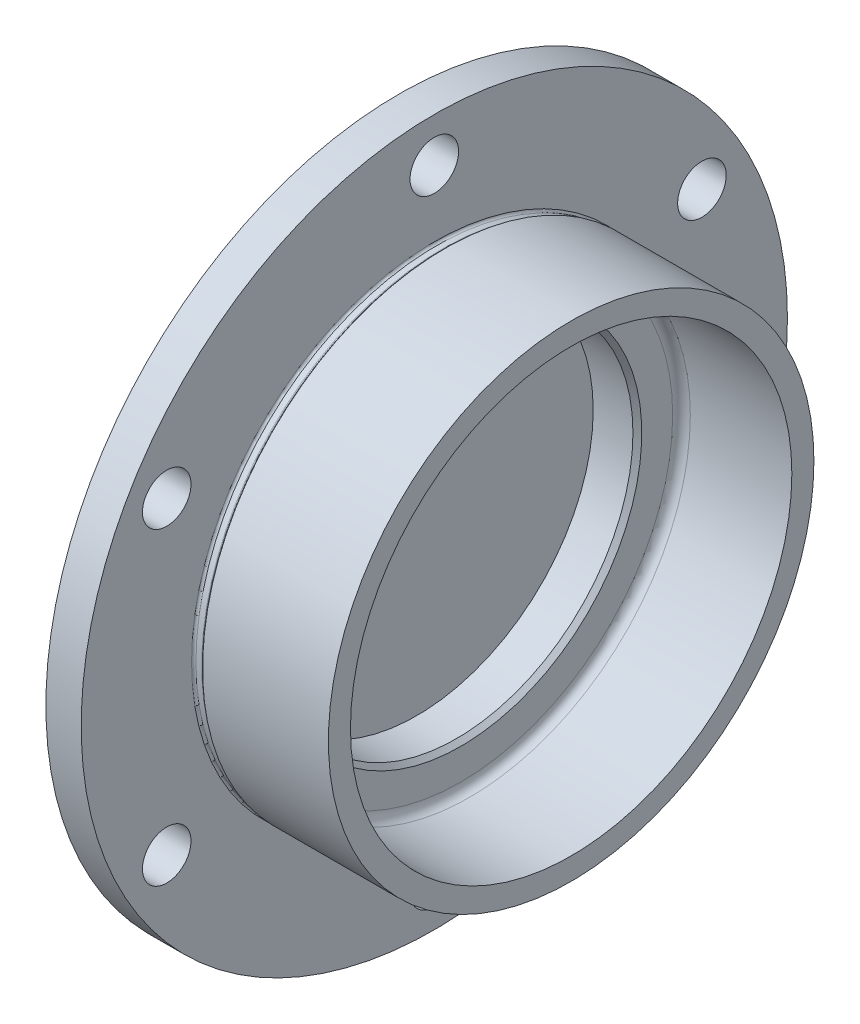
from build123d import *

# Parameters (mm, degrees)
FILLET2_R          = 0.5
CUT_EXTRUDE1_REACH = 121.67
SKETCH5_R          = 5.5
CIRPATTERN1_COUNT  = 6
CHAMFER1_SIZE      = 1
FILLET3_R          = 2


with BuildPart() as part:
    # Sketch2 → Revolve1 (revolve)
    with BuildSketch(Plane.XY, mode=Mode.PRIVATE) as revolve1_sk:
        Polygon((0, 80), (0, 0), (4, 0), (4, 40), (14, 40), (14, 50), (39, 50), (39, 55), (8, 55), (8, 80), align=None)
    revolve(revolve1_sk.sketch.rotate(Axis((29.906992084, 0, 0), (-1, 0, 0)), 90), axis=Axis((29.906992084, 0, 0), (-1, 0, 0)))

    # Sketch3 → Cut-Revolve1 (revolve, cut)
    with BuildSketch(Plane.XY, mode=Mode.PRIVATE) as cut_revolve1_sk:
        Polygon((8, 55), (8, 54.5), (10, 54.5), (10.5, 55), align=None)
    revolve(cut_revolve1_sk.sketch.rotate(Axis((36.050630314, 0, 0), (-1, 0, 0)), 90), axis=Axis((36.050630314, 0, 0), (-1, 0, 0)), mode=Mode.SUBTRACT)

    # Fillet2
    fillet2_edges = [part.edges().sort_by_distance(p)[0] for p in [
        (8, 0, 54.5),
        (10, 0, 54.5),
    ]]
    fillet(fillet2_edges, radius=FILLET2_R)

    # Sketch5 → Cut-Extrude1 (cut, up to next)
    with BuildSketch(Plane.ZY, mode=Mode.PRIVATE) as cut_extrude1_sk1:
        with Locations((0, 70)):
            Circle(SKETCH5_R)
    cut_extrude1_tool1 = extrude(cut_extrude1_sk1.sketch, amount=-CUT_EXTRUDE1_REACH, mode=Mode.PRIVATE) & part.part
    cut_extrude1 = cut_extrude1_tool1.solids().sort_by_distance((0, 70, 0))[0]
    add(cut_extrude1, mode=Mode.SUBTRACT)

    # CirPattern1: Cut-Extrude1 ×6 about axis
    cirpattern1_axis = Axis((0, 0, 0), (1, 0, 0))
    for i in range(1, CIRPATTERN1_COUNT):
        add(cut_extrude1.rotate(cirpattern1_axis, i * 360 / CIRPATTERN1_COUNT), mode=Mode.SUBTRACT)

    # Chamfer1
    chamfer1_edges = [part.edges().sort_by_distance(p)[0] for p in [
        (14, 0, 40),
    ]]
    chamfer(chamfer1_edges, length=CHAMFER1_SIZE)

    # Fillet3
    fillet3_edges = [part.edges().sort_by_distance(p)[0] for p in [
        (14, 0, 50),
    ]]
    fillet(fillet3_edges, radius=FILLET3_R)


solid = part.part
